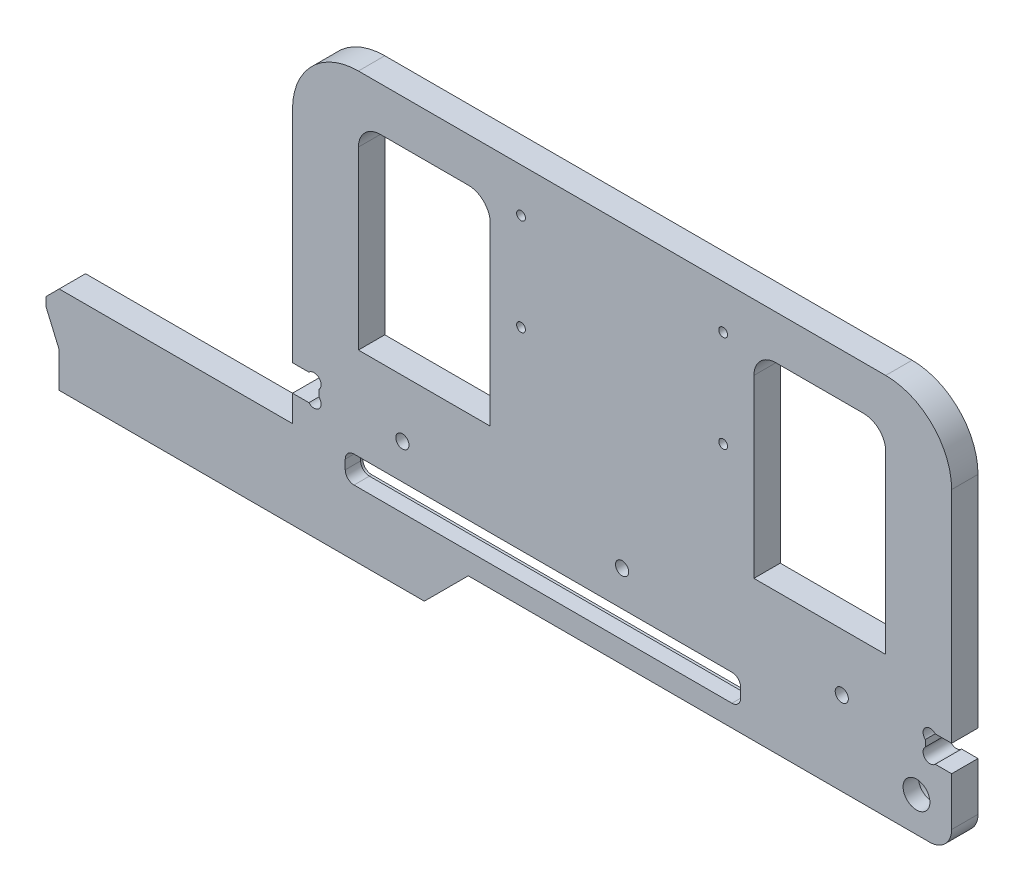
from build123d import *

# Parameters (mm, degrees)
ESQUISSE1_W             = 150
ESQUISSE1_H             = 87
BASE_EXTRUSION_DEPTH    = 6
ESQUISSE2_R             = 3.05
ESQUISSE2_R_2           = 1.5
ESQUISSE2_W             = 90
ESQUISSE2_H             = 6.1
ENL_V_MAT_EXTRU_1_DEPTH = 6
CONG_1_R                = 2
ESQUISSE4_W             = 30
ESQUISSE4_H             = 45
ENL_V_MAT_EXTRU_3_DEPTH = 6
CONG_3_R                = 5
CONG_4_R                = 15
ESQUISSE5_W             = 6
ESQUISSE5_H             = 6
ENL_V_MAT_EXTRU_4_DEPTH = 6
CONG_5_R                = 5
ESQUISSE7_R             = 1.6
ENL_V_MAT_EXTRU_5_DEPTH = 6
EXTRUSION1_DEPTH        = 6
ESQUISSE10_W            = 6
ESQUISSE10_H            = 20
EXTRUSION2_DEPTH        = 56.1
CHANFREIN1_SIZE         = 3
ENL_V_MAT_EXTRU_6_DEPTH = 146.084722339
ESQUISSE12_R            = 5
ESQUISSE12_R_2          = 3.25
ESQUISSE12_W            = 94
ESQUISSE12_H            = 10
ENL_V_MAT_EXTRU_7_DEPTH = 2.5
CONG_6_R                = 2
ESQUISSE13_R            = 1
ENL_V_MAT_EXTRU_8_DEPTH = 146.084722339


with BuildPart() as part:
    # Esquisse1 → Base-Extrusion (new body)
    with BuildSketch(Plane.XY):
        with Locations((-3.36143001, 10.663645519)):
            Rectangle(ESQUISSE1_W, ESQUISSE1_H)
    extrude(amount=BASE_EXTRUSION_DEPTH)

    # Esquisse2 → Enl_v. mat.-Extru.1 (cut)
    with BuildSketch(Plane.XY.offset(6)):
        with Locations((63.63856999, -24.936354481)):
            Circle(ESQUISSE2_R)
        with Locations((-53.36143001, -13.836354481)):
            Circle(ESQUISSE2_R_2)
        with Locations((-3.36143001, -13.836354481)):
            Circle(ESQUISSE2_R_2)
        with Locations((46.63856999, -13.836354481)):
            Circle(ESQUISSE2_R_2)
        with Locations((-21.36143001, -24.886354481)):
            Rectangle(ESQUISSE2_W, ESQUISSE2_H)
    extrude(amount=-ENL_V_MAT_EXTRU_1_DEPTH, mode=Mode.SUBTRACT)

    # Cong_1
    cong_1_edges = [part.edges().sort_by_distance(p)[0] for p in [
        (-66.36143001, -27.936354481, 3),
        (-66.36143001, -21.836354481, 3),
        (23.63856999, -21.836354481, 3),
        (23.63856999, -27.936354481, 3),
    ]]
    fillet(cong_1_edges, radius=CONG_1_R)

    # Esquisse4 → Enl_v. mat.-Extru.3 (cut)
    with BuildSketch(Plane.XY.offset(6)):
        with Locations((41.63856999, 21.663645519)):
            Rectangle(ESQUISSE4_W, ESQUISSE4_H)
        with Locations((-48.36143001, 21.663645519)):
            Rectangle(ESQUISSE4_W, ESQUISSE4_H)
    extrude(amount=-ENL_V_MAT_EXTRU_3_DEPTH, mode=Mode.SUBTRACT)

    # Cong_3
    cong_3_edges = [part.edges().sort_by_distance(p)[0] for p in [
        (26.63856999, 44.163645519, 3),
        (56.63856999, 44.163645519, 3),
        (-63.36143001, 44.163645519, 3),
        (-33.36143001, 44.163645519, 3),
    ]]
    fillet(cong_3_edges, radius=CONG_3_R)

    # Cong_4
    cong_4_edges = [part.edges().sort_by_distance(p)[0] for p in [
        (-78.36143001, 54.163645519, 3),
        (71.63856999, 54.163645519, 3),
    ]]
    fillet(cong_4_edges, radius=CONG_4_R)

    # Esquisse5 → Enl_v. mat.-Extru.4 (cut)
    with BuildSketch(Plane.XY.offset(6)):
        with Locations((68.63856999, -13.836354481)):
            Rectangle(ESQUISSE5_W, ESQUISSE5_H)
        with Locations((-75.36143001, -13.836354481)):
            Rectangle(ESQUISSE5_W, ESQUISSE5_H)
    extrude(amount=-ENL_V_MAT_EXTRU_4_DEPTH, mode=Mode.SUBTRACT)

    # Cong_5
    cong_5_edges = [part.edges().sort_by_distance(p)[0] for p in [
        (71.63856999, -32.836354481, 3),
    ]]
    fillet(cong_5_edges, radius=CONG_5_R)

    # Esquisse7 → Enl_v. mat.-Extru.5 (cut)
    with BuildSketch(Plane.XY.offset(6)):
        with Locations((-73.46143001, -11.936354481)):
            Circle(ESQUISSE7_R)
        with Locations((-73.46143001, -15.736354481)):
            Circle(ESQUISSE7_R)
        with Locations((66.73856999, -11.936354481)):
            Circle(ESQUISSE7_R)
        with Locations((66.73856999, -15.736354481)):
            Circle(ESQUISSE7_R)
    extrude(amount=-ENL_V_MAT_EXTRU_5_DEPTH, mode=Mode.SUBTRACT)

    # Esquisse8 → Extrusion1 (add)
    with BuildSketch(Plane.XY.offset(6)):
        Polygon((-78.36143001, -32.836354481), (-78.36143001, -42.836354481), (-48.36143001, -42.836354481), (-38.36143001, -32.836354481), align=None)
    extrude(amount=-EXTRUSION1_DEPTH)

    # Esquisse10 → Extrusion2 (add)
    with BuildSketch(Plane.ZY.offset(78.36143001)):
        with Locations((3, -32.836354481)):
            Rectangle(ESQUISSE10_W, ESQUISSE10_H)
    extrude(amount=EXTRUSION2_DEPTH)

    # Chanfrein1
    chanfrein1_edges = [part.edges().sort_by_distance(p)[0] for p in [
        (-134.46143001, -22.836354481, 3),
    ]]
    chamfer(chanfrein1_edges, length=CHANFREIN1_SIZE)

    # Esquisse11 → Enl_v. mat.-Extru.6 (cut, through all)
    with BuildSketch(Plane.XY.offset(6)):
        Polygon((-131.46143001, -42.836354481), (-131.46143001, -34.836354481), (-134.46143001, -27.836354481), (-138.719346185, -27.836354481), (-138.719346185, -47.249365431), (-131.46143001, -47.249365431), align=None)
    extrude(amount=-ENL_V_MAT_EXTRU_6_DEPTH, mode=Mode.SUBTRACT)

    # Esquisse12 → Enl_v. mat.-Extru.7 (cut)
    with BuildSketch(Plane(origin=(0, 0, 0), x_dir=(-1, 0, 0), z_dir=(0, 0, -1))):
        with Locations((-63.63856999, -24.936354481)):
            Circle(ESQUISSE12_R)
        with Locations((-46.63856999, -13.836354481)):
            Circle(ESQUISSE12_R_2)
        with Locations((3.36143001, -13.836354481)):
            Circle(ESQUISSE12_R_2)
        with Locations((53.36143001, -13.836354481)):
            Circle(ESQUISSE12_R_2)
        with Locations((21.36143001, -24.886354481)):
            Rectangle(ESQUISSE12_W, ESQUISSE12_H)
    extrude(amount=-ENL_V_MAT_EXTRU_7_DEPTH, mode=Mode.SUBTRACT)

    # Cong_6
    cong_6_edges = [part.edges().sort_by_distance(p)[0] for p in [
        (25.63856999, -29.886354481, 1.25),
        (25.63856999, -19.886354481, 1.25),
        (-68.36143001, -19.886354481, 1.25),
        (-68.36143001, -29.886354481, 1.25),
    ]]
    fillet(cong_6_edges, radius=CONG_6_R)

    # Esquisse13 → Enl_v. mat.-Extru.8 (cut, through all)
    with BuildSketch(Plane.XY.offset(6)):
        with Locations((-26.36143001, 44.163645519)):
            Circle(ESQUISSE13_R)
        with Locations((19.63856999, 44.163645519)):
            Circle(ESQUISSE13_R)
        with Locations((-26.36143001, 22.163645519)):
            Circle(ESQUISSE13_R)
        with Locations((19.63856999, 22.163645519)):
            Circle(ESQUISSE13_R)
    extrude(amount=-ENL_V_MAT_EXTRU_8_DEPTH, mode=Mode.SUBTRACT)


solid = part.part
